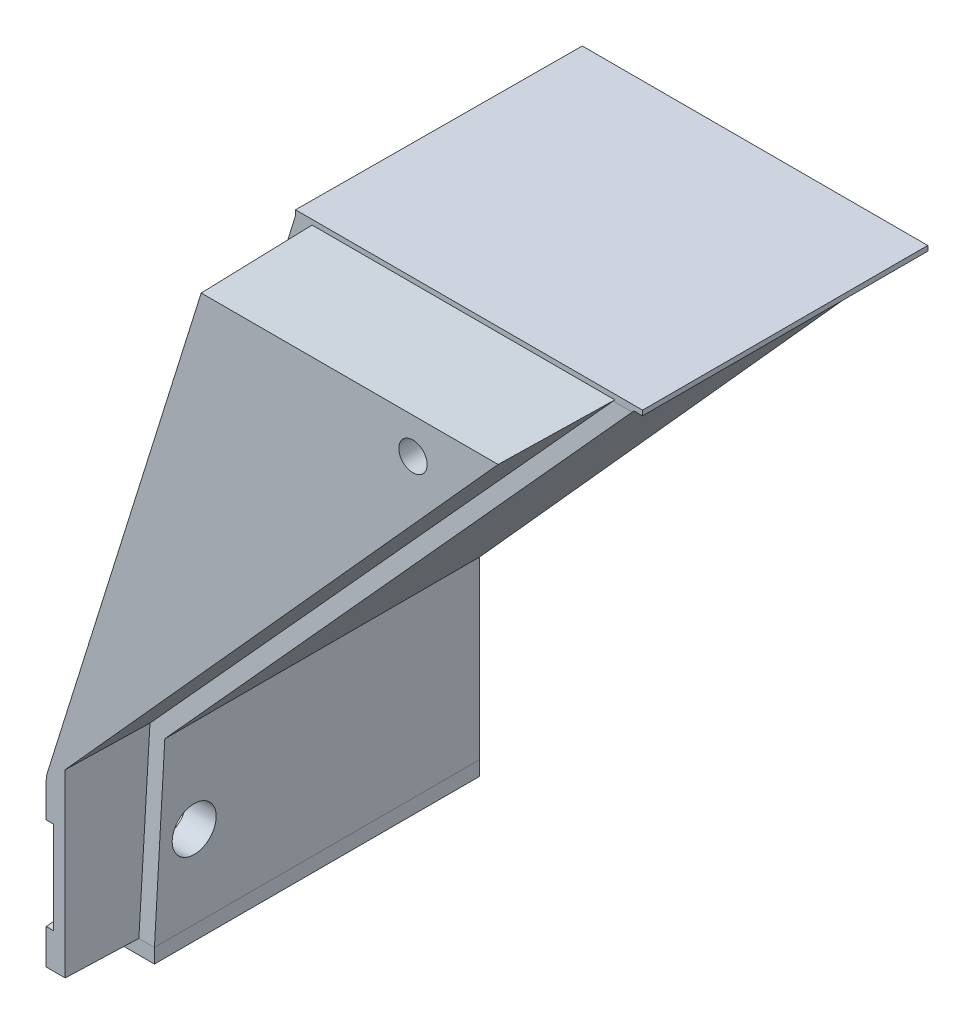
ISO-10303-21;
HEADER;
FILE_DESCRIPTION(('STEP AP214'),'2;1');
FILE_NAME('part.step','',(''),(''),'','','');
FILE_SCHEMA(('AUTOMOTIVE_DESIGN { 1 0 10303 214 1 1 1 1 }'));
ENDSEC;
DATA;
#1=APPLICATION_CONTEXT('core data for automotive mechanical design processes');
#2=APPLICATION_PROTOCOL_DEFINITION('international standard','automotive_design',2000,#1);
#3=PRODUCT_CONTEXT('',#1,'mechanical');
#4=PRODUCT('Part','Part','',(#3));
#5=PRODUCT_RELATED_PRODUCT_CATEGORY('part','',(#4));
#6=PRODUCT_DEFINITION_FORMATION('','',#4);
#7=PRODUCT_DEFINITION_CONTEXT('part definition',#1,'design');
#8=PRODUCT_DEFINITION('design','',#6,#7);
#9=PRODUCT_DEFINITION_SHAPE('','',#8);
#10=(LENGTH_UNIT() NAMED_UNIT(*) SI_UNIT(.MILLI.,.METRE.));
#11=(NAMED_UNIT(*) PLANE_ANGLE_UNIT() SI_UNIT($,.RADIAN.));
#12=(NAMED_UNIT(*) SI_UNIT($,.STERADIAN.) SOLID_ANGLE_UNIT());
#13=UNCERTAINTY_MEASURE_WITH_UNIT(LENGTH_MEASURE(1.E-05),#10,'distance_accuracy_value','');
#14=(GEOMETRIC_REPRESENTATION_CONTEXT(3) GLOBAL_UNCERTAINTY_ASSIGNED_CONTEXT((#13)) GLOBAL_UNIT_ASSIGNED_CONTEXT((#10,
#11,#12)) REPRESENTATION_CONTEXT('',''));
#15=CARTESIAN_POINT('',(0.,0.,0.));
#16=DIRECTION('',(0.,0.,1.));
#17=DIRECTION('',(1.,0.,0.));
#18=AXIS2_PLACEMENT_3D('',#15,#16,#17);
#19=CARTESIAN_POINT('',(23.3376,-29.937,-15.819588));
#20=DIRECTION('',(0.954354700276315,-0.298165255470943,-0.0174524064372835));
#21=DIRECTION('',(0.29821067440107,0.954500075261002,0.));
#22=AXIS2_PLACEMENT_3D('',#19,#20,#21);
#23=PLANE('',#22);
#24=DIRECTION('',(0.00872245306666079,-0.0305845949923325,0.999494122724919));
#25=VECTOR('',#24,1.);
#26=CARTESIAN_POINT('',(23.3362440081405,-29.9420527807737,-15.8074139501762));
#27=LINE('',#26,#25);
#28=CARTESIAN_POINT('',(23.4741932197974,-30.4257608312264,0.));
#29=VERTEX_POINT('',#28);
#30=CARTESIAN_POINT('',(23.3361377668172,-29.9416802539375,-15.819588));
#31=VERTEX_POINT('',#30);
#32=EDGE_CURVE('E378',#29,#31,#27,.F.);
#33=ORIENTED_EDGE('',*,*,#32,.F.);
#34=DIRECTION('',(0.29821067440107,0.954500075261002,0.));
#35=VECTOR('',#34,1.);
#36=CARTESIAN_POINT('',(23.6011679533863,-30.0193454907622,0.));
#37=LINE('',#36,#35);
#38=CARTESIAN_POINT('',(45.1692948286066,39.015,0.));
#39=VERTEX_POINT('',#38);
#40=EDGE_CURVE('E136',#29,#39,#37,.T.);
#41=ORIENTED_EDGE('',*,*,#40,.T.);
#42=DIRECTION('',(0.0128307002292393,-0.0174509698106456,0.999765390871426));
#43=VECTOR('',#42,1.);
#44=CARTESIAN_POINT('',(45.1467460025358,39.0456685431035,-1.75699965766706));
#45=LINE('',#44,#43);
#46=CARTESIAN_POINT('',(44.9662708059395,39.2911319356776,-15.819588));
#47=VERTEX_POINT('',#46);
#48=EDGE_CURVE('E133',#47,#39,#45,.T.);
#49=ORIENTED_EDGE('',*,*,#48,.F.);
#50=DIRECTION('',(-0.29821067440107,-0.954500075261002,0.));
#51=VECTOR('',#50,1.);
#52=CARTESIAN_POINT('',(23.3376,-29.937,-15.819588));
#53=LINE('',#52,#51);
#54=EDGE_CURVE('E140',#47,#31,#53,.T.);
#55=ORIENTED_EDGE('',*,*,#54,.T.);
#56=EDGE_LOOP('',(#33,#41,#49,#55));
#57=FACE_BOUND('',#56,.T.);
#58=ADVANCED_FACE('F36',(#57),#23,.F.);
#59=CARTESIAN_POINT('',(23.3376,-54.315,0.));
#60=DIRECTION('',(0.999961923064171,0.,-0.00872653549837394));
#61=DIRECTION('',(-0.00872653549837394,0.,-0.999961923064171));
#62=AXIS2_PLACEMENT_3D('',#59,#60,#61);
#63=PLANE('',#62);
#64=DIRECTION('',(0.00872245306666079,-0.0305845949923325,0.999494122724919));
#65=VECTOR('',#64,1.);
#66=CARTESIAN_POINT('',(23.3374777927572,-31.3206291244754,-0.0140035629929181));
#67=LINE('',#66,#65);
#68=CARTESIAN_POINT('',(23.1995445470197,-30.8369770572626,-15.819588));
#69=VERTEX_POINT('',#68);
#70=CARTESIAN_POINT('',(23.3376,-31.3210576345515,0.));
#71=VERTEX_POINT('',#70);
#72=EDGE_CURVE('E363',#69,#71,#67,.T.);
#73=ORIENTED_EDGE('',*,*,#72,.F.);
#74=DIRECTION('',(0.,1.,0.));
#75=VECTOR('',#74,1.);
#76=CARTESIAN_POINT('',(23.1995445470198,39.015,-15.819588));
#77=LINE('',#76,#75);
#78=CARTESIAN_POINT('',(23.1995445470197,-29.937,-15.819588));
#79=VERTEX_POINT('',#78);
#80=EDGE_CURVE('E633',#69,#79,#77,.T.);
#81=ORIENTED_EDGE('',*,*,#80,.T.);
#82=DIRECTION('',(0.00872653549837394,0.,0.999961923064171));
#83=VECTOR('',#82,1.);
#84=CARTESIAN_POINT('',(23.3376,-29.937,0.));
#85=LINE('',#84,#83);
#86=CARTESIAN_POINT('',(23.1907268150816,-29.937,-16.83));
#87=VERTEX_POINT('',#86);
#88=EDGE_CURVE('E670',#87,#79,#85,.T.);
#89=ORIENTED_EDGE('',*,*,#88,.F.);
#90=CARTESIAN_POINT('',(23.1907268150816,-36.057,-16.83));
#91=DIRECTION('',(0.999961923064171,0.,-0.00872653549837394));
#92=DIRECTION('',(0.00872653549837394,0.,0.999961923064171));
#93=AXIS2_PLACEMENT_3D('',#90,#91,#92);
#94=ELLIPSE('',#93,6.12023303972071,6.12);
#95=CARTESIAN_POINT('',(23.1373183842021,-36.057,-22.95));
#96=VERTEX_POINT('',#95);
#97=EDGE_CURVE('E667',#96,#87,#94,.T.);
#98=ORIENTED_EDGE('',*,*,#97,.F.);
#99=DIRECTION('',(0.,1.,0.));
#100=VECTOR('',#99,1.);
#101=CARTESIAN_POINT('',(23.1373183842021,-54.315,-22.95));
#102=LINE('',#101,#100);
#103=CARTESIAN_POINT('',(23.1373183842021,-44.115,-22.95));
#104=VERTEX_POINT('',#103);
#105=EDGE_CURVE('E658',#104,#96,#102,.T.);
#106=ORIENTED_EDGE('',*,*,#105,.F.);
#107=CARTESIAN_POINT('',(23.2263324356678,-44.115,-12.75));
#108=DIRECTION('',(0.999961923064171,0.,-0.00872653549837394));
#109=DIRECTION('',(-0.00872653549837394,0.,-0.999961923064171));
#110=AXIS2_PLACEMENT_3D('',#107,#108,#109);
#111=ELLIPSE('',#110,10.2003883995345,10.2);
#112=CARTESIAN_POINT('',(23.2263324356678,-54.315,-12.75));
#113=VERTEX_POINT('',#112);
#114=EDGE_CURVE('E657',#113,#104,#111,.T.);
#115=ORIENTED_EDGE('',*,*,#114,.F.);
#116=DIRECTION('',(0.00872653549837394,0.,0.999961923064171));
#117=VECTOR('',#116,1.);
#118=CARTESIAN_POINT('',(23.1371161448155,-54.315,-22.9731743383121));
#119=LINE('',#118,#117);
#120=CARTESIAN_POINT('',(23.2485859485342,-54.315,-10.1999999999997));
#121=VERTEX_POINT('',#120);
#122=EDGE_CURVE('E635',#113,#121,#119,.T.);
#123=ORIENTED_EDGE('',*,*,#122,.T.);
#124=DIRECTION('',(-0.0087252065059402,-0.0174517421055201,-0.999809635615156));
#125=VECTOR('',#124,1.);
#126=CARTESIAN_POINT('',(23.2472004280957,-54.3177712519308,-10.3587649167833));
#127=LINE('',#126,#125);
#128=CARTESIAN_POINT('',(23.3376,-54.1369583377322,0.));
#129=VERTEX_POINT('',#128);
#130=EDGE_CURVE('E402',#121,#129,#127,.F.);
#131=ORIENTED_EDGE('',*,*,#130,.T.);
#132=DIRECTION('',(0.,1.,0.));
#133=VECTOR('',#132,1.);
#134=CARTESIAN_POINT('',(23.3376,-54.315,0.));
#135=LINE('',#134,#133);
#136=CARTESIAN_POINT('',(23.3376,-49.189676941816,0.));
#137=VERTEX_POINT('',#136);
#138=EDGE_CURVE('E643',#129,#137,#135,.T.);
#139=ORIENTED_EDGE('',*,*,#138,.T.);
#140=DIRECTION('',(0.00869333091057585,-0.0871524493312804,0.996157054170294));
#141=VECTOR('',#140,1.);
#142=CARTESIAN_POINT('',(23.1958369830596,-47.7684732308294,-16.244432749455));
#143=LINE('',#142,#141);
#144=CARTESIAN_POINT('',(23.1957491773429,-47.7675929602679,-16.254494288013));
#145=VERTEX_POINT('',#144);
#146=EDGE_CURVE('E653',#145,#137,#143,.T.);
#147=ORIENTED_EDGE('',*,*,#146,.F.);
#148=CARTESIAN_POINT('',(23.1996282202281,-42.687,-15.81));
#149=DIRECTION('',(0.999961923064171,0.,-0.00872653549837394));
#150=DIRECTION('',(-0.00872653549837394,0.,-0.999961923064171));
#151=AXIS2_PLACEMENT_3D('',#148,#149,#150);
#152=ELLIPSE('',#151,5.10019419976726,5.1);
#153=CARTESIAN_POINT('',(23.1957491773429,-37.6064070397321,-16.254494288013));
#154=VERTEX_POINT('',#153);
#155=EDGE_CURVE('E706',#154,#145,#152,.F.);
#156=ORIENTED_EDGE('',*,*,#155,.F.);
#157=DIRECTION('',(-0.00869333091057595,-0.0871524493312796,-0.996157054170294));
#158=VECTOR('',#157,1.);
#159=CARTESIAN_POINT('',(23.3376770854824,-36.1835502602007,0.00883312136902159));
#160=LINE('',#159,#158);
#161=CARTESIAN_POINT('',(23.3376,-36.1843230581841,0.));
#162=VERTEX_POINT('',#161);
#163=EDGE_CURVE('E684',#162,#154,#160,.T.);
#164=ORIENTED_EDGE('',*,*,#163,.F.);
#165=DIRECTION('',(0.,1.,0.));
#166=VECTOR('',#165,1.);
#167=CARTESIAN_POINT('',(23.3376,-54.315,0.));
#168=LINE('',#167,#166);
#169=EDGE_CURVE('E141',#162,#71,#168,.T.);
#170=ORIENTED_EDGE('',*,*,#169,.T.);
#171=EDGE_LOOP('',(#73,#81,#89,#98,#106,#115,#123,#131,#139,#147,#156,#164,#170));
#172=FACE_BOUND('',#171,.T.);
#173=ADVANCED_FACE('F280',(#172),#63,.F.);
#174=CARTESIAN_POINT('',(-65.6145427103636,39.9924836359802,-56.));
#175=DIRECTION('',(0.,-1.,0.));
#176=DIRECTION('',(1.,0.,0.));
#177=AXIS2_PLACEMENT_3D('',#174,#175,#176);
#178=PLANE('',#177);
#179=DIRECTION('',(0.00540005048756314,0.,-0.999985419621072));
#180=VECTOR('',#179,1.);
#181=CARTESIAN_POINT('',(42.5494306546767,39.9924836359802,0.894367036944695));
#182=LINE('',#181,#180);
#183=CARTESIAN_POINT('',(42.8566734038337,39.9924871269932,-56.));
#184=VERTEX_POINT('',#183);
#185=CARTESIAN_POINT('',(42.6396881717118,39.9924836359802,-15.819588));
#186=VERTEX_POINT('',#185);
#187=EDGE_CURVE('E564',#184,#186,#182,.F.);
#188=ORIENTED_EDGE('',*,*,#187,.T.);
#189=DIRECTION('',(-1.,0.,0.));
#190=VECTOR('',#189,1.);
#191=CARTESIAN_POINT('',(-65.6145427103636,39.9924836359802,-15.819588));
#192=LINE('',#191,#190);
#193=CARTESIAN_POINT('',(91.5238680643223,39.9924836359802,-15.819588));
#194=VERTEX_POINT('',#193);
#195=EDGE_CURVE('E559',#186,#194,#192,.F.);
#196=ORIENTED_EDGE('',*,*,#195,.T.);
#197=DIRECTION('',(0.,0.,1.));
#198=VECTOR('',#197,1.);
#199=CARTESIAN_POINT('',(91.5238680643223,39.9924836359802,-61.9364789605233));
#200=LINE('',#199,#198);
#201=CARTESIAN_POINT('',(91.5238680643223,39.9924836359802,-56.));
#202=VERTEX_POINT('',#201);
#203=EDGE_CURVE('E557',#194,#202,#200,.F.);
#204=ORIENTED_EDGE('',*,*,#203,.T.);
#205=DIRECTION('',(-1.,0.,0.));
#206=VECTOR('',#205,1.);
#207=CARTESIAN_POINT('',(-91.8,39.9924836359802,-56.));
#208=LINE('',#207,#206);
#209=EDGE_CURVE('E172',#202,#184,#208,.T.);
#210=ORIENTED_EDGE('',*,*,#209,.T.);
#211=EDGE_LOOP('',(#188,#196,#204,#210));
#212=FACE_BOUND('',#211,.T.);
#213=ADVANCED_FACE('F563',(#212),#178,.F.);
#214=CARTESIAN_POINT('',(42.5502491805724,48.6764766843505,0.894371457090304));
#215=DIRECTION('',(0.99998541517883,-9.42582314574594E-05,0.00540005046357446));
#216=DIRECTION('',(0.00540005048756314,0.,-0.999985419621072));
#217=AXIS2_PLACEMENT_3D('',#214,#215,#216);
#218=PLANE('',#217);
#219=DIRECTION('',(-9.42596057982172E-05,-0.999999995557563,0.));
#220=VECTOR('',#219,1.);
#221=CARTESIAN_POINT('',(42.640506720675,48.6764681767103,-15.819588));
#222=LINE('',#221,#220);
#223=CARTESIAN_POINT('',(42.6396220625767,39.2911319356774,-15.819588));
#224=VERTEX_POINT('',#223);
#225=EDGE_CURVE('E390',#186,#224,#222,.T.);
#226=ORIENTED_EDGE('',*,*,#225,.F.);
#227=ORIENTED_EDGE('',*,*,#187,.F.);
#228=DIRECTION('',(-0.00540087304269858,-0.0174521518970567,0.99983311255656));
#229=VECTOR('',#228,1.);
#230=CARTESIAN_POINT('',(42.5502491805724,39.0023361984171,0.72550870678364));
#231=LINE('',#230,#229);
#232=EDGE_CURVE('E187',#184,#224,#231,.T.);
#233=ORIENTED_EDGE('',*,*,#232,.T.);
#234=EDGE_LOOP('',(#226,#227,#233));
#235=FACE_BOUND('',#234,.T.);
#236=ADVANCED_FACE('F252',(#235),#218,.F.);
#237=CARTESIAN_POINT('',(20.4816,-44.115,-12.75));
#238=DIRECTION('',(-1.,0.,0.));
#239=DIRECTION('',(0.,0.,1.));
#240=AXIS2_PLACEMENT_3D('',#237,#238,#239);
#241=CYLINDRICAL_SURFACE('',#240,10.2);
#242=CARTESIAN_POINT('',(20.9703045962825,-44.115,-12.75));
#243=DIRECTION('',(1.,0.,0.));
#244=DIRECTION('',(0.,0.,-1.));
#245=AXIS2_PLACEMENT_3D('',#242,#243,#244);
#246=CIRCLE('',#245,10.2);
#247=CARTESIAN_POINT('',(20.9703045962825,-54.314999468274,-12.7499999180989));
#248=VERTEX_POINT('',#247);
#249=CARTESIAN_POINT('',(20.9703045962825,-44.115,-22.95));
#250=VERTEX_POINT('',#249);
#251=EDGE_CURVE('E236',#248,#250,#246,.T.);
#252=ORIENTED_EDGE('',*,*,#251,.F.);
#253=DIRECTION('',(1.,0.,0.));
#254=VECTOR('',#253,1.);
#255=CARTESIAN_POINT('',(23.3376,-54.315,-12.75));
#256=LINE('',#255,#254);
#257=EDGE_CURVE('E655',#248,#113,#256,.T.);
#258=ORIENTED_EDGE('',*,*,#257,.T.);
#259=ORIENTED_EDGE('',*,*,#114,.T.);
#260=DIRECTION('',(1.,0.,0.));
#261=VECTOR('',#260,1.);
#262=CARTESIAN_POINT('',(20.4816,-44.115,-22.95));
#263=LINE('',#262,#261);
#264=EDGE_CURVE('E659',#104,#250,#263,.F.);
#265=ORIENTED_EDGE('',*,*,#264,.T.);
#266=EDGE_LOOP('',(#252,#258,#259,#265));
#267=FACE_BOUND('',#266,.T.);
#268=ADVANCED_FACE('F248',(#267),#241,.F.);
#269=CARTESIAN_POINT('',(5.049,41.565,-10.2));
#270=DIRECTION('',(0.,0.,-1.));
#271=DIRECTION('',(-1.,0.,0.));
#272=AXIS2_PLACEMENT_3D('',#269,#270,#271);
#273=PLANE('',#272);
#274=DIRECTION('',(0.,-1.,0.));
#275=VECTOR('',#274,1.);
#276=CARTESIAN_POINT('',(20.9703045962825,41.565,-10.2));
#277=LINE('',#276,#275);
#278=CARTESIAN_POINT('',(20.9703045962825,-56.355,-10.2));
#279=VERTEX_POINT('',#278);
#280=CARTESIAN_POINT('',(20.9703045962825,-54.315,-10.2));
#281=VERTEX_POINT('',#280);
#282=EDGE_CURVE('E192',#279,#281,#277,.F.);
#283=ORIENTED_EDGE('',*,*,#282,.F.);
#284=DIRECTION('',(1.,0.,0.));
#285=VECTOR('',#284,1.);
#286=CARTESIAN_POINT('',(5.049,-56.355,-10.2));
#287=LINE('',#286,#285);
#288=CARTESIAN_POINT('',(28.3813369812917,-56.355,-10.2));
#289=VERTEX_POINT('',#288);
#290=EDGE_CURVE('E144',#279,#289,#287,.T.);
#291=ORIENTED_EDGE('',*,*,#290,.T.);
#292=DIRECTION('',(-0.000304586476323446,-0.999999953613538,0.));
#293=VECTOR('',#292,1.);
#294=CARTESIAN_POINT('',(28.4111599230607,41.5578842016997,-10.2));
#295=LINE('',#294,#293);
#296=CARTESIAN_POINT('',(28.3819583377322,-54.315,-10.2000000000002));
#297=VERTEX_POINT('',#296);
#298=EDGE_CURVE('E163',#297,#289,#295,.T.);
#299=ORIENTED_EDGE('',*,*,#298,.F.);
#300=DIRECTION('',(-1.,0.,0.));
#301=VECTOR('',#300,1.);
#302=CARTESIAN_POINT('',(538.56,-54.315,-10.2000000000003));
#303=LINE('',#302,#301);
#304=CARTESIAN_POINT('',(26.1880416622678,-54.315,-10.2));
#305=VERTEX_POINT('',#304);
#306=EDGE_CURVE('E149',#297,#305,#303,.T.);
#307=ORIENTED_EDGE('',*,*,#306,.T.);
#308=DIRECTION('',(1.,0.,0.));
#309=VECTOR('',#308,1.);
#310=CARTESIAN_POINT('',(5.049,-54.315,-10.2));
#311=LINE('',#310,#309);
#312=EDGE_CURVE('E156',#121,#305,#311,.T.);
#313=ORIENTED_EDGE('',*,*,#312,.F.);
#314=EDGE_CURVE('E160',#281,#121,#311,.T.);
#315=ORIENTED_EDGE('',*,*,#314,.F.);
#316=EDGE_LOOP('',(#283,#291,#299,#307,#313,#315));
#317=FACE_BOUND('',#316,.T.);
#318=ADVANCED_FACE('F251',(#317),#273,.F.);
#319=CARTESIAN_POINT('',(20.4816,-54.315,-22.95));
#320=DIRECTION('',(0.,-1.,0.));
#321=DIRECTION('',(0.,0.,-1.));
#322=AXIS2_PLACEMENT_3D('',#319,#320,#321);
#323=PLANE('',#322);
#324=DIRECTION('',(0.,0.,1.));
#325=VECTOR('',#324,1.);
#326=CARTESIAN_POINT('',(20.9703045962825,-54.315,0.0302923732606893));
#327=LINE('',#326,#325);
#328=CARTESIAN_POINT('',(20.9703045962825,-54.315,-12.7467061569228));
#329=VERTEX_POINT('',#328);
#330=EDGE_CURVE('E53',#281,#329,#327,.F.);
#331=ORIENTED_EDGE('',*,*,#330,.F.);
#332=ORIENTED_EDGE('',*,*,#314,.T.);
#333=ORIENTED_EDGE('',*,*,#122,.F.);
#334=ORIENTED_EDGE('',*,*,#257,.F.);
#335=CARTESIAN_POINT('',(20.9703045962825,-54.315,-12.7467061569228));
#336=CARTESIAN_POINT('',(20.9703045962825,-54.315000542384,-12.8512262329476));
#337=CARTESIAN_POINT('',(20.9703045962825,-54.3133937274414,-12.9557462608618));
#338=CARTESIAN_POINT('',(20.9703045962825,-54.306981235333,-13.1642990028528));
#339=CARTESIAN_POINT('',(20.9703045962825,-54.3021874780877,-13.2683320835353));
#340=CARTESIAN_POINT('',(20.9703045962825,-54.2894346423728,-13.4759131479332));
#341=CARTESIAN_POINT('',(20.9703045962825,-54.2814844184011,-13.5794616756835));
#342=CARTESIAN_POINT('',(20.9703045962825,-54.2624438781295,-13.7860753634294));
#343=CARTESIAN_POINT('',(20.9703045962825,-54.2513594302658,-13.8891410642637));
#344=CARTESIAN_POINT('',(20.9703045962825,-54.2260665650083,-14.0947903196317));
#345=CARTESIAN_POINT('',(20.9703045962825,-54.2118610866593,-14.1973742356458));
#346=CARTESIAN_POINT('',(20.9703045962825,-54.1803333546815,-14.4020619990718));
#347=CARTESIAN_POINT('',(20.9703045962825,-54.1630111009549,-14.5041658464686));
#348=CARTESIAN_POINT('',(20.9703045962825,-54.1252481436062,-14.7078943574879));
#349=CARTESIAN_POINT('',(20.9703045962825,-54.1048045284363,-14.8095184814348));
#350=CARTESIAN_POINT('',(20.9703045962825,-54.0607887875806,-15.0122852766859));
#351=CARTESIAN_POINT('',(20.9703045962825,-54.0372109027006,-15.1134266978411));
#352=CARTESIAN_POINT('',(20.9703045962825,-53.9869077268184,-15.315223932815));
#353=CARTESIAN_POINT('',(20.9703045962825,-53.9601738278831,-15.415877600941));
#354=CARTESIAN_POINT('',(20.9703045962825,-53.9035316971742,-15.6166935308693));
#355=CARTESIAN_POINT('',(20.9703045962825,-53.8736119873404,-15.7168525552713));
#356=CARTESIAN_POINT('',(20.9703045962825,-53.8421593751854,-15.8165279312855));
#357=B_SPLINE_CURVE_WITH_KNOTS('',3,(#335,#336,#337,#338,#339,#340,#341,#342,#343,#344,#345,
#346,#347,#348,#349,#350,#351,#352,#353,#354,#355,#356),.UNSPECIFIED.,.F.,.F.,(4,2,2,2,2,2,2,2,
2,2,4),(0.,0.313547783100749,0.62592937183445,0.937440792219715,1.24837276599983,
1.55901318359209,1.86965361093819,2.18058558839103,2.49209700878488,2.80447859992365,
3.11802639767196),.UNSPECIFIED.);
#358=EDGE_CURVE('E571',#329,#248,#357,.T.);
#359=ORIENTED_EDGE('',*,*,#358,.F.);
#360=EDGE_LOOP('',(#331,#332,#333,#334,#359));
#361=FACE_BOUND('',#360,.T.);
#362=ADVANCED_FACE('F246',(#361),#323,.F.);
#363=CARTESIAN_POINT('',(170.,-124.,-56.));
#364=DIRECTION('',(0.,0.,1.));
#365=DIRECTION('',(1.,0.,0.));
#366=AXIS2_PLACEMENT_3D('',#363,#364,#365);
#367=PLANE('',#366);
#368=CARTESIAN_POINT('',(24.6639555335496,-43.355,-56.));
#369=DIRECTION('',(0.,0.,1.));
#370=DIRECTION('',(1.,0.,0.));
#371=AXIS2_PLACEMENT_3D('',#368,#369,#370);
#372=CIRCLE('',#371,3.);
#373=CARTESIAN_POINT('',(27.6639555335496,-43.355,-56.));
#374=VERTEX_POINT('',#373);
#375=EDGE_CURVE('E45',#374,#374,#372,.T.);
#376=ORIENTED_EDGE('',*,*,#375,.T.);
#377=EDGE_LOOP('',(#376));
#378=FACE_BOUND('',#377,.T.);
#379=CARTESIAN_POINT('',(62.0000177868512,24.1988680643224,-56.));
#380=DIRECTION('',(0.,0.,1.));
#381=DIRECTION('',(1.,0.,0.));
#382=AXIS2_PLACEMENT_3D('',#379,#380,#381);
#383=CIRCLE('',#382,4.);
#384=CARTESIAN_POINT('',(66.0000177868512,24.1988680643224,-56.));
#385=VERTEX_POINT('',#384);
#386=EDGE_CURVE('E235',#385,#385,#383,.T.);
#387=ORIENTED_EDGE('',*,*,#386,.T.);
#388=EDGE_LOOP('',(#387));
#389=FACE_BOUND('',#388,.T.);
#390=CARTESIAN_POINT('',(47.0000080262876,7.,-56.));
#391=DIRECTION('',(0.,0.,1.));
#392=DIRECTION('',(1.,0.,0.));
#393=AXIS2_PLACEMENT_3D('',#390,#391,#392);
#394=CIRCLE('',#393,4.);
#395=CARTESIAN_POINT('',(51.0000080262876,7.,-56.));
#396=VERTEX_POINT('',#395);
#397=EDGE_CURVE('E348',#396,#396,#394,.T.);
#398=ORIENTED_EDGE('',*,*,#397,.T.);
#399=EDGE_LOOP('',(#398));
#400=FACE_BOUND('',#399,.T.);
#401=CARTESIAN_POINT('',(21.1044951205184,-30.2965631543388,-56.));
#402=CARTESIAN_POINT('',(21.0820336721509,-30.3691489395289,-56.));
#403=CARTESIAN_POINT('',(21.0623486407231,-30.4425774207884,-56.));
#404=CARTESIAN_POINT('',(21.0285971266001,-30.5907141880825,-56.));
#405=CARTESIAN_POINT('',(21.0145305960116,-30.665422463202,-56.));
#406=CARTESIAN_POINT('',(20.9813947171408,-30.8872594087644,-56.));
#407=CARTESIAN_POINT('',(20.9703129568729,-31.0356183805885,-56.));
#408=CARTESIAN_POINT('',(20.9703045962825,-31.1841392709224,-56.));
#409=B_SPLINE_CURVE_WITH_KNOTS('',3,(#401,#402,#403,#404,#405,#406,#407,#408),.UNSPECIFIED.,.F.,
.F.,(4,2,2,4),(0.,0.227859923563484,0.455717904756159,0.900514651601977),.UNSPECIFIED.);
#410=CARTESIAN_POINT('',(21.1044951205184,-30.2965631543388,-56.));
#411=VERTEX_POINT('',#410);
#412=CARTESIAN_POINT('',(20.9703045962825,-31.1841392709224,-56.));
#413=VERTEX_POINT('',#412);
#414=EDGE_CURVE('E184',#411,#413,#409,.T.);
#415=ORIENTED_EDGE('',*,*,#414,.F.);
#416=DIRECTION('',(-0.295634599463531,-0.955301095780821,0.));
#417=VECTOR('',#416,1.);
#418=CARTESIAN_POINT('',(31.9265236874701,4.67328058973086,-56.));
#419=LINE('',#418,#417);
#420=EDGE_CURVE('E169',#184,#411,#419,.T.);
#421=ORIENTED_EDGE('',*,*,#420,.F.);
#422=ORIENTED_EDGE('',*,*,#209,.F.);
#423=DIRECTION('',(0.,1.,0.));
#424=VECTOR('',#423,1.);
#425=CARTESIAN_POINT('',(91.5238680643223,62.1988680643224,-56.));
#426=LINE('',#425,#424);
#427=CARTESIAN_POINT('',(91.5238680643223,39.2911319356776,-56.));
#428=VERTEX_POINT('',#427);
#429=EDGE_CURVE('E549',#428,#202,#426,.T.);
#430=ORIENTED_EDGE('',*,*,#429,.F.);
#431=DIRECTION('',(1.,0.,0.));
#432=VECTOR('',#431,1.);
#433=CARTESIAN_POINT('',(91.5238680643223,39.2911319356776,-56.));
#434=LINE('',#433,#432);
#435=CARTESIAN_POINT('',(90.3091950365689,39.2911319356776,-56.));
#436=VERTEX_POINT('',#435);
#437=EDGE_CURVE('E552',#436,#428,#434,.T.);
#438=ORIENTED_EDGE('',*,*,#437,.F.);
#439=DIRECTION('',(0.668549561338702,0.743667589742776,0.));
#440=VECTOR('',#439,1.);
#441=CARTESIAN_POINT('',(90.3091950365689,39.2911319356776,-56.));
#442=LINE('',#441,#440);
#443=CARTESIAN_POINT('',(28.3560070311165,-29.6230977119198,-56.));
#444=VERTEX_POINT('',#443);
#445=EDGE_CURVE('E78',#444,#436,#442,.T.);
#446=ORIENTED_EDGE('',*,*,#445,.F.);
#447=DIRECTION('',(-0.00105100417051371,0.999999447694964,0.));
#448=VECTOR('',#447,1.);
#449=CARTESIAN_POINT('',(28.3560070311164,-29.6230977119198,-56.));
#450=LINE('',#449,#448);
#451=CARTESIAN_POINT('',(28.3819583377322,-54.315,-56.));
#452=VERTEX_POINT('',#451);
#453=EDGE_CURVE('E748',#452,#444,#450,.T.);
#454=ORIENTED_EDGE('',*,*,#453,.F.);
#455=DIRECTION('',(-0.000304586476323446,-0.999999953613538,0.));
#456=VECTOR('',#455,1.);
#457=CARTESIAN_POINT('',(28.3607463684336,-123.956858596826,-56.));
#458=LINE('',#457,#456);
#459=CARTESIAN_POINT('',(28.3813369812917,-56.355,-56.));
#460=VERTEX_POINT('',#459);
#461=EDGE_CURVE('E165',#452,#460,#458,.T.);
#462=ORIENTED_EDGE('',*,*,#461,.T.);
#463=DIRECTION('',(-1.,0.,0.));
#464=VECTOR('',#463,1.);
#465=CARTESIAN_POINT('',(5.049,-56.355,-56.));
#466=LINE('',#465,#464);
#467=CARTESIAN_POINT('',(20.9703045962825,-56.355,-56.));
#468=VERTEX_POINT('',#467);
#469=EDGE_CURVE('E166',#468,#460,#466,.F.);
#470=ORIENTED_EDGE('',*,*,#469,.F.);
#471=DIRECTION('',(0.,-1.,0.));
#472=VECTOR('',#471,1.);
#473=CARTESIAN_POINT('',(20.9703045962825,-41.6589844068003,-56.));
#474=LINE('',#473,#472);
#475=EDGE_CURVE('E178',#413,#468,#474,.T.);
#476=ORIENTED_EDGE('',*,*,#475,.F.);
#477=EDGE_LOOP('',(#415,#421,#422,#430,#438,#446,#454,#462,#470,#476));
#478=FACE_BOUND('',#477,.T.);
#479=CARTESIAN_POINT('',(75.0000080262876,33.9924836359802,-56.));
#480=DIRECTION('',(0.,0.,1.));
#481=DIRECTION('',(1.,0.,0.));
#482=AXIS2_PLACEMENT_3D('',#479,#480,#481);
#483=CIRCLE('',#482,2.);
#484=CARTESIAN_POINT('',(77.0000080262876,33.9924836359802,-56.));
#485=VERTEX_POINT('',#484);
#486=EDGE_CURVE('E345',#485,#485,#483,.F.);
#487=ORIENTED_EDGE('',*,*,#486,.F.);
#488=EDGE_LOOP('',(#487));
#489=FACE_BOUND('',#488,.T.);
#490=ADVANCED_FACE('F244',(#378,#389,#400,#478,#489),#367,.F.);
#491=CARTESIAN_POINT('',(23.3376,-36.057,-16.83));
#492=DIRECTION('',(1.,0.,0.));
#493=DIRECTION('',(0.,0.,-1.));
#494=AXIS2_PLACEMENT_3D('',#491,#492,#493);
#495=CYLINDRICAL_SURFACE('',#494,6.12);
#496=CARTESIAN_POINT('',(20.9703045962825,-36.057,-16.83));
#497=DIRECTION('',(1.,0.,0.));
#498=DIRECTION('',(0.,0.,-1.));
#499=AXIS2_PLACEMENT_3D('',#496,#497,#498);
#500=CIRCLE('',#499,6.12);
#501=CARTESIAN_POINT('',(20.9703045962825,-36.057,-22.95));
#502=VERTEX_POINT('',#501);
#503=CARTESIAN_POINT('',(20.9703045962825,-31.1841392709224,-20.5326515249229));
#504=VERTEX_POINT('',#503);
#505=EDGE_CURVE('E676',#502,#504,#500,.T.);
#506=ORIENTED_EDGE('',*,*,#505,.F.);
#507=DIRECTION('',(-1.,0.,0.));
#508=VECTOR('',#507,1.);
#509=CARTESIAN_POINT('',(23.3376,-36.057,-22.95));
#510=LINE('',#509,#508);
#511=EDGE_CURVE('E662',#502,#96,#510,.F.);
#512=ORIENTED_EDGE('',*,*,#511,.T.);
#513=ORIENTED_EDGE('',*,*,#97,.T.);
#514=DIRECTION('',(-1.,0.,0.));
#515=VECTOR('',#514,1.);
#516=CARTESIAN_POINT('',(20.4816,-29.937,-16.83));
#517=LINE('',#516,#515);
#518=CARTESIAN_POINT('',(21.2157682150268,-29.937,-16.83));
#519=VERTEX_POINT('',#518);
#520=EDGE_CURVE('E664',#87,#519,#517,.T.);
#521=ORIENTED_EDGE('',*,*,#520,.T.);
#522=CARTESIAN_POINT('',(19.3218273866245,-36.057,-16.83));
#523=DIRECTION('',(0.955301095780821,-0.295634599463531,0.));
#524=DIRECTION('',(0.295634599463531,0.955301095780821,0.));
#525=AXIS2_PLACEMENT_3D('',#522,#523,#524);
#526=ELLIPSE('',#525,6.40635714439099,6.12);
#527=CARTESIAN_POINT('',(21.1044951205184,-30.2965631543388,-18.8968254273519));
#528=VERTEX_POINT('',#527);
#529=EDGE_CURVE('E183',#519,#528,#526,.F.);
#530=ORIENTED_EDGE('',*,*,#529,.T.);
#531=CARTESIAN_POINT('',(20.9703045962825,-31.1841392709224,-20.5326515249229));
#532=CARTESIAN_POINT('',(20.9703075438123,-31.1381480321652,-20.4721267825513));
#533=CARTESIAN_POINT('',(20.9713679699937,-31.0932939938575,-20.4107539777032));
#534=CARTESIAN_POINT('',(20.9752998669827,-31.0059371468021,-20.2864332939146));
#535=CARTESIAN_POINT('',(20.9781709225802,-30.9634338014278,-20.2234857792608));
#536=CARTESIAN_POINT('',(20.9873905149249,-30.8583873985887,-20.0614940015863));
#537=CARTESIAN_POINT('',(20.9947809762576,-30.7975080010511,-19.9614254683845));
#538=CARTESIAN_POINT('',(21.0121261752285,-30.6816554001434,-19.7581001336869));
#539=CARTESIAN_POINT('',(21.0220820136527,-30.6266847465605,-19.6548419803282));
#540=CARTESIAN_POINT('',(21.043752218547,-30.5220517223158,-19.4439629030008));
#541=CARTESIAN_POINT('',(21.0554900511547,-30.4724781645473,-19.3363003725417));
#542=CARTESIAN_POINT('',(21.0796834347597,-30.379716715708,-19.1184202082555));
#543=CARTESIAN_POINT('',(21.0921385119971,-30.3365246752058,-19.0082042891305));
#544=CARTESIAN_POINT('',(21.1044951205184,-30.2965631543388,-18.896825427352));
#545=B_SPLINE_CURVE_WITH_KNOTS('',3,(#531,#532,#533,#534,#535,#536,#537,#538,#539,#540,#541,
#542,#543,#544),.UNSPECIFIED.,.F.,.F.,(4,2,2,2,2,2,4),(0.,0.228006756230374,0.455961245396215,
0.807809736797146,1.15980945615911,1.51692771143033,1.87381272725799),.UNSPECIFIED.);
#546=EDGE_CURVE('E228',#504,#528,#545,.T.);
#547=ORIENTED_EDGE('',*,*,#546,.F.);
#548=EDGE_LOOP('',(#506,#512,#513,#521,#530,#547));
#549=FACE_BOUND('',#548,.T.);
#550=ADVANCED_FACE('F238',(#549),#495,.F.);
#551=CARTESIAN_POINT('',(20.4816,-54.315,-22.95));
#552=DIRECTION('',(0.,0.,1.));
#553=DIRECTION('',(1.,0.,0.));
#554=AXIS2_PLACEMENT_3D('',#551,#552,#553);
#555=PLANE('',#554);
#556=ORIENTED_EDGE('',*,*,#511,.F.);
#557=DIRECTION('',(0.,1.,0.));
#558=VECTOR('',#557,1.);
#559=CARTESIAN_POINT('',(20.9703045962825,-54.315,-22.95));
#560=LINE('',#559,#558);
#561=EDGE_CURVE('E727',#502,#250,#560,.F.);
#562=ORIENTED_EDGE('',*,*,#561,.T.);
#563=ORIENTED_EDGE('',*,*,#264,.F.);
#564=ORIENTED_EDGE('',*,*,#105,.T.);
#565=EDGE_LOOP('',(#556,#562,#563,#564));
#566=FACE_BOUND('',#565,.T.);
#567=ADVANCED_FACE('F243',(#566),#555,.T.);
#568=CARTESIAN_POINT('',(91.5238680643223,62.1988680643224,-61.719588));
#569=DIRECTION('',(-1.,0.,0.));
#570=DIRECTION('',(0.,0.,1.));
#571=AXIS2_PLACEMENT_3D('',#568,#569,#570);
#572=PLANE('',#571);
#573=ORIENTED_EDGE('',*,*,#203,.F.);
#574=DIRECTION('',(0.,1.,0.));
#575=VECTOR('',#574,1.);
#576=CARTESIAN_POINT('',(91.5238680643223,39.015,-15.819588));
#577=LINE('',#576,#575);
#578=CARTESIAN_POINT('',(91.5238680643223,39.2911319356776,-15.819588));
#579=VERTEX_POINT('',#578);
#580=EDGE_CURVE('E361',#579,#194,#577,.T.);
#581=ORIENTED_EDGE('',*,*,#580,.F.);
#582=DIRECTION('',(0.,0.,1.));
#583=VECTOR('',#582,1.);
#584=CARTESIAN_POINT('',(91.5238680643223,39.2911319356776,-61.719588));
#585=LINE('',#584,#583);
#586=EDGE_CURVE('E112',#428,#579,#585,.T.);
#587=ORIENTED_EDGE('',*,*,#586,.F.);
#588=ORIENTED_EDGE('',*,*,#429,.T.);
#589=EDGE_LOOP('',(#573,#581,#587,#588));
#590=FACE_BOUND('',#589,.T.);
#591=ADVANCED_FACE('F282',(#590),#572,.F.);
#592=CARTESIAN_POINT('',(91.5238680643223,39.2911319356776,-61.719588));
#593=DIRECTION('',(0.,1.,0.));
#594=DIRECTION('',(0.,0.,1.));
#595=AXIS2_PLACEMENT_3D('',#592,#593,#594);
#596=PLANE('',#595);
#597=DIRECTION('',(0.,0.,1.));
#598=VECTOR('',#597,1.);
#599=CARTESIAN_POINT('',(90.3091950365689,39.2911319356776,-61.719588));
#600=LINE('',#599,#598);
#601=CARTESIAN_POINT('',(90.3091950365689,39.2911319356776,-15.819588));
#602=VERTEX_POINT('',#601);
#603=EDGE_CURVE('E94',#436,#602,#600,.T.);
#604=ORIENTED_EDGE('',*,*,#603,.F.);
#605=ORIENTED_EDGE('',*,*,#437,.T.);
#606=ORIENTED_EDGE('',*,*,#586,.T.);
#607=DIRECTION('',(-1.,0.,0.));
#608=VECTOR('',#607,1.);
#609=CARTESIAN_POINT('',(91.8,39.2911319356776,-15.819588));
#610=LINE('',#609,#608);
#611=EDGE_CURVE('E102',#579,#602,#610,.T.);
#612=ORIENTED_EDGE('',*,*,#611,.T.);
#613=EDGE_LOOP('',(#604,#605,#606,#612));
#614=FACE_BOUND('',#613,.T.);
#615=ADVANCED_FACE('F115',(#614),#596,.F.);
#616=CARTESIAN_POINT('',(91.8,39.015,-15.819588));
#617=DIRECTION('',(0.,0.,1.));
#618=DIRECTION('',(1.,0.,0.));
#619=AXIS2_PLACEMENT_3D('',#616,#617,#618);
#620=PLANE('',#619);
#621=DIRECTION('',(0.668549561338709,0.74366758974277,0.));
#622=VECTOR('',#621,1.);
#623=CARTESIAN_POINT('',(90.0609552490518,39.0150000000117,-15.819588));
#624=LINE('',#623,#622);
#625=CARTESIAN_POINT('',(90.0609552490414,39.015,-15.819588));
#626=VERTEX_POINT('',#625);
#627=EDGE_CURVE('E97',#626,#602,#624,.T.);
#628=ORIENTED_EDGE('',*,*,#627,.T.);
#629=ORIENTED_EDGE('',*,*,#611,.F.);
#630=ORIENTED_EDGE('',*,*,#580,.T.);
#631=ORIENTED_EDGE('',*,*,#195,.F.);
#632=ORIENTED_EDGE('',*,*,#225,.T.);
#633=DIRECTION('',(0.295634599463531,0.955301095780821,0.));
#634=VECTOR('',#633,1.);
#635=CARTESIAN_POINT('',(31.9265236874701,4.67328058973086,-15.819588));
#636=LINE('',#635,#634);
#637=CARTESIAN_POINT('',(21.2157682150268,-29.937,-15.819588));
#638=VERTEX_POINT('',#637);
#639=EDGE_CURVE('E180',#638,#224,#636,.T.);
#640=ORIENTED_EDGE('',*,*,#639,.F.);
#641=DIRECTION('',(-1.,0.,0.));
#642=VECTOR('',#641,1.);
#643=CARTESIAN_POINT('',(20.4816,-29.937,-15.819588));
#644=LINE('',#643,#642);
#645=EDGE_CURVE('E640',#79,#638,#644,.T.);
#646=ORIENTED_EDGE('',*,*,#645,.F.);
#647=ORIENTED_EDGE('',*,*,#80,.F.);
#648=CARTESIAN_POINT('',(26.199658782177,-30.8377781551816,-15.819588));
#649=DIRECTION('',(0.,0.,1.));
#650=DIRECTION('',(-0.274255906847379,0.961656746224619,0.));
#651=AXIS2_PLACEMENT_3D('',#648,#649,#650);
#652=ELLIPSE('',#651,3.00151839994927,3.);
#653=EDGE_CURVE('E387',#31,#69,#652,.T.);
#654=ORIENTED_EDGE('',*,*,#653,.F.);
#655=ORIENTED_EDGE('',*,*,#54,.F.);
#656=DIRECTION('',(1.,0.,0.));
#657=VECTOR('',#656,1.);
#658=CARTESIAN_POINT('',(91.8,39.2911319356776,-15.819588));
#659=LINE('',#658,#657);
#660=CARTESIAN_POINT('',(87.6213664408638,39.2911319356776,-15.819588));
#661=VERTEX_POINT('',#660);
#662=EDGE_CURVE('E364',#47,#661,#659,.T.);
#663=ORIENTED_EDGE('',*,*,#662,.T.);
#664=DIRECTION('',(0.669130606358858,0.743144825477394,0.));
#665=VECTOR('',#664,1.);
#666=CARTESIAN_POINT('',(87.2063699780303,38.830231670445,-15.819588));
#667=LINE('',#666,#665);
#668=CARTESIAN_POINT('',(87.3727361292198,39.015,-15.819588));
#669=VERTEX_POINT('',#668);
#670=EDGE_CURVE('E127',#669,#661,#667,.T.);
#671=ORIENTED_EDGE('',*,*,#670,.F.);
#672=DIRECTION('',(1.,0.,0.));
#673=VECTOR('',#672,1.);
#674=CARTESIAN_POINT('',(90.4325274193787,39.015,-15.819588));
#675=LINE('',#674,#673);
#676=EDGE_CURVE('E111',#669,#626,#675,.T.);
#677=ORIENTED_EDGE('',*,*,#676,.T.);
#678=EDGE_LOOP('',(#628,#629,#630,#631,#632,#640,#646,#647,#654,#655,#663,#671,#677));
#679=FACE_BOUND('',#678,.T.);
#680=ADVANCED_FACE('F106',(#679),#620,.T.);
#681=CARTESIAN_POINT('',(951.868,-42.687,-15.81));
#682=DIRECTION('',(-1.,0.,0.));
#683=DIRECTION('',(0.,0.,1.));
#684=AXIS2_PLACEMENT_3D('',#681,#682,#683);
#685=CYLINDRICAL_SURFACE('',#684,3.1);
#686=CARTESIAN_POINT('',(28.3697372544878,-42.687,-15.81));
#687=DIRECTION('',(-0.999999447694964,-0.00105100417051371,0.));
#688=DIRECTION('',(-0.00105100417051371,0.999999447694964,0.));
#689=AXIS2_PLACEMENT_3D('',#686,#687,#688);
#690=ELLIPSE('',#689,3.10000171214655,3.1);
#691=CARTESIAN_POINT('',(28.3664791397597,-39.587,-15.81));
#692=VERTEX_POINT('',#691);
#693=EDGE_CURVE('E162',#692,#692,#690,.F.);
#694=ORIENTED_EDGE('',*,*,#693,.T.);
#695=EDGE_LOOP('',(#694));
#696=FACE_BOUND('',#695,.T.);
#697=CARTESIAN_POINT('',(24.219628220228,-42.687,-15.81));
#698=DIRECTION('',(0.999961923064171,0.,-0.00872653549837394));
#699=DIRECTION('',(-0.00872653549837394,0.,-0.999961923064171));
#700=AXIS2_PLACEMENT_3D('',#697,#698,#699);
#701=ELLIPSE('',#700,3.10011804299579,3.1);
#702=CARTESIAN_POINT('',(24.1925749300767,-42.6870000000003,-18.91));
#703=VERTEX_POINT('',#702);
#704=EDGE_CURVE('E719',#703,#703,#701,.T.);
#705=ORIENTED_EDGE('',*,*,#704,.F.);
#706=EDGE_LOOP('',(#705));
#707=FACE_BOUND('',#706,.T.);
#708=ADVANCED_FACE('F262',(#696,#707),#685,.F.);
#709=CARTESIAN_POINT('',(87.0011639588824,39.015,0.));
#710=DIRECTION('',(-0.743031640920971,0.669028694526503,-0.0174524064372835));
#711=DIRECTION('',(-0.669130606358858,-0.743144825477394,0.));
#712=AXIS2_PLACEMENT_3D('',#709,#710,#711);
#713=PLANE('',#712);
#714=DIRECTION('',(-0.669130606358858,-0.743144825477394,0.));
#715=VECTOR('',#714,1.);
#716=CARTESIAN_POINT('',(87.0011639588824,39.015,0.));
#717=LINE('',#716,#715);
#718=CARTESIAN_POINT('',(87.0011639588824,39.015,0.));
#719=VERTEX_POINT('',#718);
#720=CARTESIAN_POINT('',(26.01,-28.722549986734,0.));
#721=VERTEX_POINT('',#720);
#722=EDGE_CURVE('E126',#719,#721,#717,.T.);
#723=ORIENTED_EDGE('',*,*,#722,.T.);
#724=DIRECTION('',(-0.01745201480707,0.00669920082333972,0.999825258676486));
#725=VECTOR('',#724,1.);
#726=CARTESIAN_POINT('',(26.0206567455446,-28.7266407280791,-0.610524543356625));
#727=LINE('',#726,#725);
#728=CARTESIAN_POINT('',(26.2148568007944,-28.8011871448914,-11.7362382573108));
#729=VERTEX_POINT('',#728);
#730=EDGE_CURVE('E358',#729,#721,#727,.T.);
#731=ORIENTED_EDGE('',*,*,#730,.F.);
#732=DIRECTION('',(0.66904191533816,0.741881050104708,-0.0446701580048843));
#733=VECTOR('',#732,1.);
#734=CARTESIAN_POINT('',(86.7336265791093,38.306310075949,-15.7769163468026));
#735=LINE('',#734,#733);
#736=EDGE_CURVE('E130',#729,#669,#735,.T.);
#737=ORIENTED_EDGE('',*,*,#736,.T.);
#738=ORIENTED_EDGE('',*,*,#670,.T.);
#739=DIRECTION('',(-0.0391686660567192,-0.0174390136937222,0.999080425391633));
#740=VECTOR('',#739,1.);
#741=CARTESIAN_POINT('',(87.0011639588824,39.015,0.));
#742=LINE('',#741,#740);
#743=EDGE_CURVE('E123',#661,#719,#742,.T.);
#744=ORIENTED_EDGE('',*,*,#743,.T.);
#745=EDGE_LOOP('',(#723,#731,#737,#738,#744));
#746=FACE_BOUND('',#745,.T.);
#747=ADVANCED_FACE('F265',(#746),#713,.F.);
#748=CARTESIAN_POINT('',(538.56,-54.315,-10.2000000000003));
#749=DIRECTION('',(0.,0.0601031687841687,0.998192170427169));
#750=DIRECTION('',(0.,-0.998192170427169,0.0601031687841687));
#751=AXIS2_PLACEMENT_3D('',#748,#749,#750);
#752=PLANE('',#751);
#753=ORIENTED_EDGE('',*,*,#736,.F.);
#754=DIRECTION('',(0.00104910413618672,0.998191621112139,-0.0601031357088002));
#755=VECTOR('',#754,1.);
#756=CARTESIAN_POINT('',(26.2141989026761,-29.4271577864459,-11.6985472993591));
#757=LINE('',#756,#755);
#758=EDGE_CURVE('E396',#305,#729,#757,.T.);
#759=ORIENTED_EDGE('',*,*,#758,.F.);
#760=ORIENTED_EDGE('',*,*,#306,.F.);
#761=DIRECTION('',(0.00104910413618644,-0.998191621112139,0.0601031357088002));
#762=VECTOR('',#761,1.);
#763=CARTESIAN_POINT('',(28.3826016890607,-54.927129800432,-10.1631424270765));
#764=LINE('',#763,#762);
#765=CARTESIAN_POINT('',(28.3560070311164,-29.6230977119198,-11.6867493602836));
#766=VERTEX_POINT('',#765);
#767=EDGE_CURVE('E674',#766,#297,#764,.T.);
#768=ORIENTED_EDGE('',*,*,#767,.F.);
#769=DIRECTION('',(-0.667880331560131,-0.742923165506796,0.0447329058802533));
#770=VECTOR('',#769,1.);
#771=CARTESIAN_POINT('',(28.0589910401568,-29.953486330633,-11.666855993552));
#772=LINE('',#771,#770);
#773=EDGE_CURVE('E67',#626,#766,#772,.T.);
#774=ORIENTED_EDGE('',*,*,#773,.F.);
#775=ORIENTED_EDGE('',*,*,#676,.F.);
#776=EDGE_LOOP('',(#753,#759,#760,#768,#774,#775));
#777=FACE_BOUND('',#776,.T.);
#778=ADVANCED_FACE('F272',(#777),#752,.T.);
#779=CARTESIAN_POINT('',(90.3091950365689,39.2911319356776,-61.719588));
#780=DIRECTION('',(-0.743667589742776,0.668549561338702,0.));
#781=DIRECTION('',(-0.668549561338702,-0.743667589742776,0.));
#782=AXIS2_PLACEMENT_3D('',#779,#780,#781);
#783=PLANE('',#782);
#784=ORIENTED_EDGE('',*,*,#773,.T.);
#785=DIRECTION('',(0.,0.,1.));
#786=VECTOR('',#785,1.);
#787=CARTESIAN_POINT('',(28.3560070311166,-29.6230977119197,-61.719588));
#788=LINE('',#787,#786);
#789=EDGE_CURVE('E747',#444,#766,#788,.T.);
#790=ORIENTED_EDGE('',*,*,#789,.F.);
#791=ORIENTED_EDGE('',*,*,#445,.T.);
#792=ORIENTED_EDGE('',*,*,#603,.T.);
#793=ORIENTED_EDGE('',*,*,#627,.F.);
#794=EDGE_LOOP('',(#784,#790,#791,#792,#793));
#795=FACE_BOUND('',#794,.T.);
#796=ADVANCED_FACE('F96',(#795),#783,.F.);
#797=CARTESIAN_POINT('',(5.049,-56.355,-10.2));
#798=DIRECTION('',(0.,-1.,0.));
#799=DIRECTION('',(1.,0.,0.));
#800=AXIS2_PLACEMENT_3D('',#797,#798,#799);
#801=PLANE('',#800);
#802=ORIENTED_EDGE('',*,*,#290,.F.);
#803=DIRECTION('',(0.,0.,-1.));
#804=VECTOR('',#803,1.);
#805=CARTESIAN_POINT('',(20.9703045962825,-56.355,-56.));
#806=LINE('',#805,#804);
#807=EDGE_CURVE('E191',#279,#468,#806,.T.);
#808=ORIENTED_EDGE('',*,*,#807,.T.);
#809=ORIENTED_EDGE('',*,*,#469,.T.);
#810=DIRECTION('',(0.,0.,1.));
#811=VECTOR('',#810,1.);
#812=CARTESIAN_POINT('',(28.3813369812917,-56.355,-60.2));
#813=LINE('',#812,#811);
#814=EDGE_CURVE('E88',#460,#289,#813,.T.);
#815=ORIENTED_EDGE('',*,*,#814,.T.);
#816=EDGE_LOOP('',(#802,#808,#809,#815));
#817=FACE_BOUND('',#816,.T.);
#818=ADVANCED_FACE('F290',(#817),#801,.T.);
#819=CARTESIAN_POINT('',(-91.8,64.515,0.));
#820=DIRECTION('',(0.,0.,1.));
#821=DIRECTION('',(1.,0.,0.));
#822=AXIS2_PLACEMENT_3D('',#819,#820,#821);
#823=PLANE('',#822);
#824=CARTESIAN_POINT('',(26.3377142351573,-31.3218587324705,0.));
#825=DIRECTION('',(0.,0.,1.));
#826=DIRECTION('',(-0.274255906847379,0.961656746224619,0.));
#827=AXIS2_PLACEMENT_3D('',#824,#825,#826);
#828=ELLIPSE('',#827,3.00151839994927,3.);
#829=EDGE_CURVE('E374',#71,#29,#828,.F.);
#830=ORIENTED_EDGE('',*,*,#829,.F.);
#831=ORIENTED_EDGE('',*,*,#169,.F.);
#832=DIRECTION('',(-1.,0.,0.));
#833=VECTOR('',#832,1.);
#834=CARTESIAN_POINT('',(24.3576,-36.1843230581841,0.));
#835=LINE('',#834,#833);
#836=CARTESIAN_POINT('',(24.3576,-36.1843230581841,0.));
#837=VERTEX_POINT('',#836);
#838=EDGE_CURVE('E397',#837,#162,#835,.T.);
#839=ORIENTED_EDGE('',*,*,#838,.F.);
#840=DIRECTION('',(0.,1.,0.));
#841=VECTOR('',#840,1.);
#842=CARTESIAN_POINT('',(24.3576,-49.189676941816,0.));
#843=LINE('',#842,#841);
#844=CARTESIAN_POINT('',(24.3576,-49.189676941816,0.));
#845=VERTEX_POINT('',#844);
#846=EDGE_CURVE('E679',#845,#837,#843,.T.);
#847=ORIENTED_EDGE('',*,*,#846,.F.);
#848=DIRECTION('',(-1.,0.,0.));
#849=VECTOR('',#848,1.);
#850=CARTESIAN_POINT('',(24.3576,-49.189676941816,0.));
#851=LINE('',#850,#849);
#852=EDGE_CURVE('E672',#845,#137,#851,.T.);
#853=ORIENTED_EDGE('',*,*,#852,.T.);
#854=ORIENTED_EDGE('',*,*,#138,.F.);
#855=DIRECTION('',(-1.,0.,0.));
#856=VECTOR('',#855,1.);
#857=CARTESIAN_POINT('',(5.049,-54.1369583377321,0.));
#858=LINE('',#857,#856);
#859=CARTESIAN_POINT('',(26.01,-54.1369583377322,0.));
#860=VERTEX_POINT('',#859);
#861=EDGE_CURVE('E626',#129,#860,#858,.F.);
#862=ORIENTED_EDGE('',*,*,#861,.T.);
#863=DIRECTION('',(0.,-1.,0.));
#864=VECTOR('',#863,1.);
#865=CARTESIAN_POINT('',(26.01,-28.722549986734,0.));
#866=LINE('',#865,#864);
#867=EDGE_CURVE('E393',#721,#860,#866,.T.);
#868=ORIENTED_EDGE('',*,*,#867,.F.);
#869=ORIENTED_EDGE('',*,*,#722,.F.);
#870=DIRECTION('',(1.,0.,0.));
#871=VECTOR('',#870,1.);
#872=CARTESIAN_POINT('',(-91.8,39.015,0.));
#873=LINE('',#872,#871);
#874=EDGE_CURVE('E121',#39,#719,#873,.T.);
#875=ORIENTED_EDGE('',*,*,#874,.F.);
#876=ORIENTED_EDGE('',*,*,#40,.F.);
#877=EDGE_LOOP('',(#830,#831,#839,#847,#853,#854,#862,#868,#869,#875,#876));
#878=FACE_BOUND('',#877,.T.);
#879=CARTESIAN_POINT('',(75.0000080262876,33.9924836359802,0.));
#880=DIRECTION('',(0.,0.,1.));
#881=DIRECTION('',(1.,0.,0.));
#882=AXIS2_PLACEMENT_3D('',#879,#880,#881);
#883=CIRCLE('',#882,2.);
#884=CARTESIAN_POINT('',(77.0000080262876,33.9924836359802,0.));
#885=VERTEX_POINT('',#884);
#886=EDGE_CURVE('E351',#885,#885,#883,.T.);
#887=ORIENTED_EDGE('',*,*,#886,.F.);
#888=EDGE_LOOP('',(#887));
#889=FACE_BOUND('',#888,.T.);
#890=ADVANCED_FACE('F293',(#878,#889),#823,.T.);
#891=CARTESIAN_POINT('',(28.3560070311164,-29.6230977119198,-61.719588));
#892=DIRECTION('',(-0.999999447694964,-0.00105100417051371,0.));
#893=DIRECTION('',(0.00105100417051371,-0.999999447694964,0.));
#894=AXIS2_PLACEMENT_3D('',#891,#892,#893);
#895=PLANE('',#894);
#896=ORIENTED_EDGE('',*,*,#789,.T.);
#897=ORIENTED_EDGE('',*,*,#767,.T.);
#898=DIRECTION('',(0.,0.,1.));
#899=VECTOR('',#898,1.);
#900=CARTESIAN_POINT('',(28.3819583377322,-54.315,-61.719588));
#901=LINE('',#900,#899);
#902=EDGE_CURVE('E745',#452,#297,#901,.T.);
#903=ORIENTED_EDGE('',*,*,#902,.F.);
#904=ORIENTED_EDGE('',*,*,#453,.T.);
#905=EDGE_LOOP('',(#896,#897,#903,#904));
#906=FACE_BOUND('',#905,.T.);
#907=ORIENTED_EDGE('',*,*,#693,.F.);
#908=EDGE_LOOP('',(#907));
#909=FACE_BOUND('',#908,.T.);
#910=ADVANCED_FACE('F261',(#906,#909),#895,.F.);
#911=CARTESIAN_POINT('',(28.4111599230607,41.5578842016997,-60.2));
#912=DIRECTION('',(-0.999999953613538,0.000304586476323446,0.));
#913=DIRECTION('',(-0.000304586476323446,-0.999999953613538,0.));
#914=AXIS2_PLACEMENT_3D('',#911,#912,#913);
#915=PLANE('',#914);
#916=ORIENTED_EDGE('',*,*,#902,.T.);
#917=ORIENTED_EDGE('',*,*,#298,.T.);
#918=ORIENTED_EDGE('',*,*,#814,.F.);
#919=ORIENTED_EDGE('',*,*,#461,.F.);
#920=EDGE_LOOP('',(#916,#917,#918,#919));
#921=FACE_BOUND('',#920,.T.);
#922=ADVANCED_FACE('F257',(#921),#915,.F.);
#923=CARTESIAN_POINT('',(24.3576,-49.189676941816,0.));
#924=DIRECTION('',(0.999961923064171,0.,-0.00872653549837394));
#925=DIRECTION('',(-0.00872653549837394,0.,-0.999961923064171));
#926=AXIS2_PLACEMENT_3D('',#923,#924,#925);
#927=PLANE('',#926);
#928=CARTESIAN_POINT('',(24.2196282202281,-42.687,-15.81));
#929=DIRECTION('',(0.999961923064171,0.,-0.00872653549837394));
#930=DIRECTION('',(-0.00872653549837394,0.,-0.999961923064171));
#931=AXIS2_PLACEMENT_3D('',#928,#929,#930);
#932=ELLIPSE('',#931,5.10019419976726,5.1);
#933=CARTESIAN_POINT('',(24.2157491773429,-37.6064070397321,-16.254494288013));
#934=VERTEX_POINT('',#933);
#935=CARTESIAN_POINT('',(24.2157491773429,-47.7675929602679,-16.254494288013));
#936=VERTEX_POINT('',#935);
#937=EDGE_CURVE('E148',#934,#936,#932,.F.);
#938=ORIENTED_EDGE('',*,*,#937,.T.);
#939=DIRECTION('',(-0.00869333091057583,0.0871524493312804,-0.996157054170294));
#940=VECTOR('',#939,1.);
#941=CARTESIAN_POINT('',(24.3576,-49.189676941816,0.));
#942=LINE('',#941,#940);
#943=EDGE_CURVE('E682',#936,#845,#942,.F.);
#944=ORIENTED_EDGE('',*,*,#943,.T.);
#945=ORIENTED_EDGE('',*,*,#846,.T.);
#946=DIRECTION('',(0.00869333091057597,0.0871524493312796,0.996157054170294));
#947=VECTOR('',#946,1.);
#948=CARTESIAN_POINT('',(24.3477465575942,-36.2831058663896,-1.12909266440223));
#949=LINE('',#948,#947);
#950=EDGE_CURVE('E681',#837,#934,#949,.F.);
#951=ORIENTED_EDGE('',*,*,#950,.T.);
#952=EDGE_LOOP('',(#938,#944,#945,#951));
#953=FACE_BOUND('',#952,.T.);
#954=ORIENTED_EDGE('',*,*,#704,.T.);
#955=EDGE_LOOP('',(#954));
#956=FACE_BOUND('',#955,.T.);
#957=ADVANCED_FACE('F260',(#953,#956),#927,.F.);
#958=CARTESIAN_POINT('',(24.3576,-42.687,-15.81));
#959=DIRECTION('',(-1.,0.,0.));
#960=DIRECTION('',(0.,0.,1.));
#961=AXIS2_PLACEMENT_3D('',#958,#959,#960);
#962=CYLINDRICAL_SURFACE('',#961,5.1);
#963=ORIENTED_EDGE('',*,*,#155,.T.);
#964=DIRECTION('',(-1.,0.,0.));
#965=VECTOR('',#964,1.);
#966=CARTESIAN_POINT('',(24.3576,-47.7675929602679,-16.254494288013));
#967=LINE('',#966,#965);
#968=EDGE_CURVE('E707',#936,#145,#967,.T.);
#969=ORIENTED_EDGE('',*,*,#968,.F.);
#970=ORIENTED_EDGE('',*,*,#937,.F.);
#971=DIRECTION('',(-1.,0.,0.));
#972=VECTOR('',#971,1.);
#973=CARTESIAN_POINT('',(24.3576,-37.6064070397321,-16.254494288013));
#974=LINE('',#973,#972);
#975=EDGE_CURVE('E704',#934,#154,#974,.T.);
#976=ORIENTED_EDGE('',*,*,#975,.T.);
#977=EDGE_LOOP('',(#963,#969,#970,#976));
#978=FACE_BOUND('',#977,.T.);
#979=ADVANCED_FACE('F787',(#978),#962,.F.);
#980=CARTESIAN_POINT('',(24.3576,-47.7675929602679,-16.254494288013));
#981=DIRECTION('',(0.,-0.996194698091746,-0.0871557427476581));
#982=DIRECTION('',(0.,0.0871557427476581,-0.996194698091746));
#983=AXIS2_PLACEMENT_3D('',#980,#981,#982);
#984=PLANE('',#983);
#985=ORIENTED_EDGE('',*,*,#146,.T.);
#986=ORIENTED_EDGE('',*,*,#852,.F.);
#987=ORIENTED_EDGE('',*,*,#943,.F.);
#988=ORIENTED_EDGE('',*,*,#968,.T.);
#989=EDGE_LOOP('',(#985,#986,#987,#988));
#990=FACE_BOUND('',#989,.T.);
#991=ADVANCED_FACE('F692',(#990),#984,.F.);
#992=CARTESIAN_POINT('',(24.3576,-36.1843230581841,0.));
#993=DIRECTION('',(0.,0.996194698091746,-0.0871557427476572));
#994=DIRECTION('',(0.,0.0871557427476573,0.996194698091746));
#995=AXIS2_PLACEMENT_3D('',#992,#993,#994);
#996=PLANE('',#995);
#997=ORIENTED_EDGE('',*,*,#163,.T.);
#998=ORIENTED_EDGE('',*,*,#975,.F.);
#999=ORIENTED_EDGE('',*,*,#950,.F.);
#1000=ORIENTED_EDGE('',*,*,#838,.T.);
#1001=EDGE_LOOP('',(#997,#998,#999,#1000));
#1002=FACE_BOUND('',#1001,.T.);
#1003=ADVANCED_FACE('F781',(#1002),#996,.F.);
#1004=CARTESIAN_POINT('',(26.01,-28.722549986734,0.));
#1005=DIRECTION('',(-0.999847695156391,0.,-0.0174524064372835));
#1006=DIRECTION('',(-0.0174524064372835,0.,0.999847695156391));
#1007=AXIS2_PLACEMENT_3D('',#1004,#1005,#1006);
#1008=PLANE('',#1007);
#1009=ORIENTED_EDGE('',*,*,#758,.T.);
#1010=ORIENTED_EDGE('',*,*,#730,.T.);
#1011=ORIENTED_EDGE('',*,*,#867,.T.);
#1012=DIRECTION('',(0.0174497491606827,-0.0174497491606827,-0.999695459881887));
#1013=VECTOR('',#1012,1.);
#1014=CARTESIAN_POINT('',(26.0022614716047,-54.1292198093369,0.443339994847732));
#1015=LINE('',#1014,#1013);
#1016=EDGE_CURVE('E159',#305,#860,#1015,.F.);
#1017=ORIENTED_EDGE('',*,*,#1016,.F.);
#1018=EDGE_LOOP('',(#1009,#1010,#1011,#1017));
#1019=FACE_BOUND('',#1018,.T.);
#1020=ADVANCED_FACE('F630',(#1019),#1008,.F.);
#1021=CARTESIAN_POINT('',(23.3376,-29.937,-22.95));
#1022=DIRECTION('',(0.,1.,0.));
#1023=DIRECTION('',(0.,0.,1.));
#1024=AXIS2_PLACEMENT_3D('',#1021,#1022,#1023);
#1025=PLANE('',#1024);
#1026=ORIENTED_EDGE('',*,*,#645,.T.);
#1027=DIRECTION('',(0.,0.,-1.));
#1028=VECTOR('',#1027,1.);
#1029=CARTESIAN_POINT('',(21.2157682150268,-29.937,-22.95));
#1030=LINE('',#1029,#1028);
#1031=EDGE_CURVE('E736',#638,#519,#1030,.T.);
#1032=ORIENTED_EDGE('',*,*,#1031,.T.);
#1033=ORIENTED_EDGE('',*,*,#520,.F.);
#1034=ORIENTED_EDGE('',*,*,#88,.T.);
#1035=EDGE_LOOP('',(#1026,#1032,#1033,#1034));
#1036=FACE_BOUND('',#1035,.T.);
#1037=ADVANCED_FACE('F739',(#1036),#1025,.F.);
#1038=CARTESIAN_POINT('',(5.049,-54.315,-10.2));
#1039=DIRECTION('',(0.,0.999847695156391,-0.0174524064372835));
#1040=DIRECTION('',(0.,0.0174524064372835,0.999847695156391));
#1041=AXIS2_PLACEMENT_3D('',#1038,#1039,#1040);
#1042=PLANE('',#1041);
#1043=ORIENTED_EDGE('',*,*,#312,.T.);
#1044=ORIENTED_EDGE('',*,*,#1016,.T.);
#1045=ORIENTED_EDGE('',*,*,#861,.F.);
#1046=ORIENTED_EDGE('',*,*,#130,.F.);
#1047=EDGE_LOOP('',(#1043,#1044,#1045,#1046));
#1048=FACE_BOUND('',#1047,.T.);
#1049=ADVANCED_FACE('F218',(#1048),#1042,.F.);
#1050=CARTESIAN_POINT('',(21.1044951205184,-30.2965631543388,-56.));
#1051=CARTESIAN_POINT('',(21.0156883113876,-30.5835297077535,-56.));
#1052=CARTESIAN_POINT('',(20.9703045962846,-30.8837110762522,-56.));
#1053=CARTESIAN_POINT('',(20.9703045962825,-31.1841392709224,-56.));
#1054=CARTESIAN_POINT('',(21.1044951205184,-30.2965631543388,-7.7835056));
#1055=CARTESIAN_POINT('',(21.0156883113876,-30.5835297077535,-7.7835056));
#1056=CARTESIAN_POINT('',(20.9703045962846,-30.8837110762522,-7.7835056));
#1057=CARTESIAN_POINT('',(20.9703045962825,-31.1841392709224,-7.7835056));
#1058=B_SPLINE_SURFACE_WITH_KNOTS('',1,3,((#1050,#1051,#1052,#1053),(#1054,#1055,#1056,#1057)),
.UNSPECIFIED.,.F.,.F.,.F.,(2,2),(4,4),(0.,1.),(0.99470527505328,1.29492501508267),.UNSPECIFIED.);
#1059=DIRECTION('',(0.,0.,-1.));
#1060=VECTOR('',#1059,1.);
#1061=CARTESIAN_POINT('',(21.1044951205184,-30.2965631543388,-56.));
#1062=LINE('',#1061,#1060);
#1063=EDGE_CURVE('E193',#528,#411,#1062,.T.);
#1064=DIRECTION('',(0.,0.,-1.));
#1065=VECTOR('',#1064,1.);
#1066=CARTESIAN_POINT('',(20.9703045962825,-31.1841392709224,-56.));
#1067=LINE('',#1066,#1065);
#1068=EDGE_CURVE('E763',#413,#504,#1067,.F.);
#1069=ORIENTED_EDGE('',*,*,#546,.T.);
#1070=ORIENTED_EDGE('',*,*,#1063,.T.);
#1071=ORIENTED_EDGE('',*,*,#414,.T.);
#1072=ORIENTED_EDGE('',*,*,#1068,.T.);
#1073=EDGE_LOOP('',(#1069,#1070,#1071,#1072));
#1074=FACE_BOUND('',#1073,.T.);
#1075=ADVANCED_FACE('F211',(#1074),#1058,.F.);
#1076=CARTESIAN_POINT('',(20.9703045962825,-29.937,-56.));
#1077=DIRECTION('',(1.,0.,0.));
#1078=DIRECTION('',(0.,0.,-1.));
#1079=AXIS2_PLACEMENT_3D('',#1076,#1077,#1078);
#1080=PLANE('',#1079);
#1081=ORIENTED_EDGE('',*,*,#475,.T.);
#1082=ORIENTED_EDGE('',*,*,#807,.F.);
#1083=ORIENTED_EDGE('',*,*,#282,.T.);
#1084=ORIENTED_EDGE('',*,*,#330,.T.);
#1085=ORIENTED_EDGE('',*,*,#358,.T.);
#1086=ORIENTED_EDGE('',*,*,#251,.T.);
#1087=ORIENTED_EDGE('',*,*,#561,.F.);
#1088=ORIENTED_EDGE('',*,*,#505,.T.);
#1089=ORIENTED_EDGE('',*,*,#1068,.F.);
#1090=EDGE_LOOP('',(#1081,#1082,#1083,#1084,#1085,#1086,#1087,#1088,#1089));
#1091=FACE_BOUND('',#1090,.T.);
#1092=ADVANCED_FACE('F217',(#1091),#1080,.F.);
#1093=CARTESIAN_POINT('',(31.9265236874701,4.67328058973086,-56.));
#1094=DIRECTION('',(0.955301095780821,-0.295634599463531,0.));
#1095=DIRECTION('',(0.295634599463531,0.955301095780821,0.));
#1096=AXIS2_PLACEMENT_3D('',#1093,#1094,#1095);
#1097=PLANE('',#1096);
#1098=ORIENTED_EDGE('',*,*,#1031,.F.);
#1099=ORIENTED_EDGE('',*,*,#639,.T.);
#1100=ORIENTED_EDGE('',*,*,#232,.F.);
#1101=ORIENTED_EDGE('',*,*,#420,.T.);
#1102=ORIENTED_EDGE('',*,*,#1063,.F.);
#1103=ORIENTED_EDGE('',*,*,#529,.F.);
#1104=EDGE_LOOP('',(#1098,#1099,#1100,#1101,#1102,#1103));
#1105=FACE_BOUND('',#1104,.T.);
#1106=ADVANCED_FACE('F220',(#1105),#1097,.F.);
#1107=CARTESIAN_POINT('',(-91.8,39.015,0.));
#1108=DIRECTION('',(0.,-0.999847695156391,-0.0174524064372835));
#1109=DIRECTION('',(0.,0.0174524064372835,-0.999847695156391));
#1110=AXIS2_PLACEMENT_3D('',#1107,#1108,#1109);
#1111=PLANE('',#1110);
#1112=ORIENTED_EDGE('',*,*,#48,.T.);
#1113=ORIENTED_EDGE('',*,*,#874,.T.);
#1114=ORIENTED_EDGE('',*,*,#743,.F.);
#1115=ORIENTED_EDGE('',*,*,#662,.F.);
#1116=EDGE_LOOP('',(#1112,#1113,#1114,#1115));
#1117=FACE_BOUND('',#1116,.T.);
#1118=ADVANCED_FACE('F590',(#1117),#1111,.F.);
#1119=CARTESIAN_POINT('',(26.3436199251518,-31.3425665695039,0.676725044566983));
#1120=DIRECTION('',(-0.00872245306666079,0.0305845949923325,-0.999494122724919));
#1121=DIRECTION('',(0.,0.999532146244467,0.0305857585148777));
#1122=AXIS2_PLACEMENT_3D('',#1119,#1120,#1121);
#1123=CYLINDRICAL_SURFACE('',#1122,3.);
#1124=ORIENTED_EDGE('',*,*,#653,.T.);
#1125=ORIENTED_EDGE('',*,*,#72,.T.);
#1126=ORIENTED_EDGE('',*,*,#829,.T.);
#1127=ORIENTED_EDGE('',*,*,#32,.T.);
#1128=EDGE_LOOP('',(#1124,#1125,#1126,#1127));
#1129=FACE_BOUND('',#1128,.T.);
#1130=ADVANCED_FACE('F586',(#1129),#1123,.T.);
#1131=CARTESIAN_POINT('',(47.0000080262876,7.,-6.));
#1132=DIRECTION('',(0.,0.,-1.));
#1133=DIRECTION('',(-1.,0.,0.));
#1134=AXIS2_PLACEMENT_3D('',#1131,#1132,#1133);
#1135=CONICAL_SURFACE('',#1134,4.,1.02974425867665);
#1136=CARTESIAN_POINT('',(47.0000080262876,7.,-6.));
#1137=DIRECTION('',(0.,0.,1.));
#1138=DIRECTION('',(1.,0.,0.));
#1139=AXIS2_PLACEMENT_3D('',#1136,#1137,#1138);
#1140=CIRCLE('',#1139,4.);
#1141=CARTESIAN_POINT('',(51.0000080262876,7.,-6.));
#1142=VERTEX_POINT('',#1141);
#1143=EDGE_CURVE('E355',#1142,#1142,#1140,.T.);
#1144=ORIENTED_EDGE('',*,*,#1143,.F.);
#1145=EDGE_LOOP('',(#1144));
#1146=FACE_BOUND('',#1145,.T.);
#1147=CARTESIAN_POINT('',(47.0000080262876,7.,-3.59655752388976));
#1148=VERTEX_POINT('',#1147);
#1149=VERTEX_LOOP('',#1148);
#1150=FACE_BOUND('',#1149,.T.);
#1151=ADVANCED_FACE('F589',(#1146,#1150),#1135,.F.);
#1152=CARTESIAN_POINT('',(47.0000080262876,7.,-56.));
#1153=DIRECTION('',(0.,0.,1.));
#1154=DIRECTION('',(1.,0.,0.));
#1155=AXIS2_PLACEMENT_3D('',#1152,#1153,#1154);
#1156=CYLINDRICAL_SURFACE('',#1155,4.);
#1157=ORIENTED_EDGE('',*,*,#1143,.T.);
#1158=EDGE_LOOP('',(#1157));
#1159=FACE_BOUND('',#1158,.T.);
#1160=ORIENTED_EDGE('',*,*,#397,.F.);
#1161=EDGE_LOOP('',(#1160));
#1162=FACE_BOUND('',#1161,.T.);
#1163=ADVANCED_FACE('F594',(#1159,#1162),#1156,.F.);
#1164=CARTESIAN_POINT('',(62.0000177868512,24.1988680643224,-39.));
#1165=DIRECTION('',(0.,0.,-1.));
#1166=DIRECTION('',(-1.,0.,0.));
#1167=AXIS2_PLACEMENT_3D('',#1164,#1165,#1166);
#1168=CONICAL_SURFACE('',#1167,3.4,1.02974425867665);
#1169=CARTESIAN_POINT('',(62.0000177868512,24.1988680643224,-39.));
#1170=DIRECTION('',(0.,0.,1.));
#1171=DIRECTION('',(1.,0.,0.));
#1172=AXIS2_PLACEMENT_3D('',#1169,#1170,#1171);
#1173=CIRCLE('',#1172,3.4);
#1174=CARTESIAN_POINT('',(65.4000177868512,24.1988680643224,-39.));
#1175=VERTEX_POINT('',#1174);
#1176=EDGE_CURVE('E344',#1175,#1175,#1173,.T.);
#1177=ORIENTED_EDGE('',*,*,#1176,.F.);
#1178=EDGE_LOOP('',(#1177));
#1179=FACE_BOUND('',#1178,.T.);
#1180=CARTESIAN_POINT('',(62.0000177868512,24.1988680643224,-36.9570738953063));
#1181=VERTEX_POINT('',#1180);
#1182=VERTEX_LOOP('',#1181);
#1183=FACE_BOUND('',#1182,.T.);
#1184=ADVANCED_FACE('F312',(#1179,#1183),#1168,.F.);
#1185=CARTESIAN_POINT('',(62.0000177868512,24.1988680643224,-56.));
#1186=DIRECTION('',(0.,0.,1.));
#1187=DIRECTION('',(1.,0.,0.));
#1188=AXIS2_PLACEMENT_3D('',#1185,#1186,#1187);
#1189=CYLINDRICAL_SURFACE('',#1188,3.4);
#1190=CARTESIAN_POINT('',(62.0000177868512,24.1988680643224,-55.4));
#1191=DIRECTION('',(0.,0.,1.));
#1192=DIRECTION('',(1.,0.,0.));
#1193=AXIS2_PLACEMENT_3D('',#1190,#1191,#1192);
#1194=CIRCLE('',#1193,3.4);
#1195=CARTESIAN_POINT('',(65.4000177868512,24.1988680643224,-55.4));
#1196=VERTEX_POINT('',#1195);
#1197=EDGE_CURVE('E318',#1196,#1196,#1194,.F.);
#1198=ORIENTED_EDGE('',*,*,#1197,.T.);
#1199=EDGE_LOOP('',(#1198));
#1200=FACE_BOUND('',#1199,.T.);
#1201=ORIENTED_EDGE('',*,*,#1176,.T.);
#1202=EDGE_LOOP('',(#1201));
#1203=FACE_BOUND('',#1202,.T.);
#1204=ADVANCED_FACE('F303',(#1200,#1203),#1189,.F.);
#1205=CARTESIAN_POINT('',(62.0000177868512,24.1988680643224,-56.));
#1206=DIRECTION('',(0.,0.,-1.));
#1207=DIRECTION('',(-1.,0.,0.));
#1208=AXIS2_PLACEMENT_3D('',#1205,#1206,#1207);
#1209=CONICAL_SURFACE('',#1208,4.,0.785398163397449);
#1210=ORIENTED_EDGE('',*,*,#1197,.F.);
#1211=EDGE_LOOP('',(#1210));
#1212=FACE_BOUND('',#1211,.T.);
#1213=ORIENTED_EDGE('',*,*,#386,.F.);
#1214=EDGE_LOOP('',(#1213));
#1215=FACE_BOUND('',#1214,.T.);
#1216=ADVANCED_FACE('F300',(#1212,#1215),#1209,.F.);
#1217=CARTESIAN_POINT('',(24.6639555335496,-43.355,-43.));
#1218=DIRECTION('',(0.,0.,-1.));
#1219=DIRECTION('',(-1.,0.,0.));
#1220=AXIS2_PLACEMENT_3D('',#1217,#1218,#1219);
#1221=CONICAL_SURFACE('',#1220,2.6,1.02974425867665);
#1222=CARTESIAN_POINT('',(24.6639555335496,-43.355,-43.));
#1223=DIRECTION('',(0.,0.,1.));
#1224=DIRECTION('',(1.,0.,0.));
#1225=AXIS2_PLACEMENT_3D('',#1222,#1223,#1224);
#1226=CIRCLE('',#1225,2.6);
#1227=CARTESIAN_POINT('',(27.2639555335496,-43.355,-43.));
#1228=VERTEX_POINT('',#1227);
#1229=EDGE_CURVE('E343',#1228,#1228,#1226,.T.);
#1230=ORIENTED_EDGE('',*,*,#1229,.F.);
#1231=EDGE_LOOP('',(#1230));
#1232=FACE_BOUND('',#1231,.T.);
#1233=CARTESIAN_POINT('',(24.6639555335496,-43.355,-41.4377623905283));
#1234=VERTEX_POINT('',#1233);
#1235=VERTEX_LOOP('',#1234);
#1236=FACE_BOUND('',#1235,.T.);
#1237=ADVANCED_FACE('F302',(#1232,#1236),#1221,.F.);
#1238=CARTESIAN_POINT('',(24.6639555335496,-43.355,-56.));
#1239=DIRECTION('',(0.,0.,1.));
#1240=DIRECTION('',(1.,0.,0.));
#1241=AXIS2_PLACEMENT_3D('',#1238,#1239,#1240);
#1242=CYLINDRICAL_SURFACE('',#1241,2.6);
#1243=CARTESIAN_POINT('',(24.6639555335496,-43.355,-55.6));
#1244=DIRECTION('',(0.,0.,1.));
#1245=DIRECTION('',(1.,0.,0.));
#1246=AXIS2_PLACEMENT_3D('',#1243,#1244,#1245);
#1247=CIRCLE('',#1246,2.6);
#1248=CARTESIAN_POINT('',(27.2639555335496,-43.355,-55.6));
#1249=VERTEX_POINT('',#1248);
#1250=EDGE_CURVE('E11',#1249,#1249,#1247,.F.);
#1251=ORIENTED_EDGE('',*,*,#1250,.T.);
#1252=EDGE_LOOP('',(#1251));
#1253=FACE_BOUND('',#1252,.T.);
#1254=ORIENTED_EDGE('',*,*,#1229,.T.);
#1255=EDGE_LOOP('',(#1254));
#1256=FACE_BOUND('',#1255,.T.);
#1257=ADVANCED_FACE('F309',(#1253,#1256),#1242,.F.);
#1258=CARTESIAN_POINT('',(24.6639555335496,-43.355,-56.));
#1259=DIRECTION('',(0.,0.,-1.));
#1260=DIRECTION('',(-1.,0.,0.));
#1261=AXIS2_PLACEMENT_3D('',#1258,#1259,#1260);
#1262=CONICAL_SURFACE('',#1261,3.,0.78539816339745);
#1263=ORIENTED_EDGE('',*,*,#1250,.F.);
#1264=EDGE_LOOP('',(#1263));
#1265=FACE_BOUND('',#1264,.T.);
#1266=ORIENTED_EDGE('',*,*,#375,.F.);
#1267=EDGE_LOOP('',(#1266));
#1268=FACE_BOUND('',#1267,.T.);
#1269=ADVANCED_FACE('F38',(#1265,#1268),#1262,.F.);
#1270=CARTESIAN_POINT('',(75.0000080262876,33.9924836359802,-64.4852813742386));
#1271=DIRECTION('',(0.,0.,1.));
#1272=DIRECTION('',(1.,0.,0.));
#1273=AXIS2_PLACEMENT_3D('',#1270,#1271,#1272);
#1274=CYLINDRICAL_SURFACE('',#1273,2.);
#1275=ORIENTED_EDGE('',*,*,#486,.T.);
#1276=EDGE_LOOP('',(#1275));
#1277=FACE_BOUND('',#1276,.T.);
#1278=ORIENTED_EDGE('',*,*,#886,.T.);
#1279=EDGE_LOOP('',(#1278));
#1280=FACE_BOUND('',#1279,.T.);
#1281=ADVANCED_FACE('F329',(#1277,#1280),#1274,.F.);
#1282=CLOSED_SHELL('',(#58,#173,#213,#236,#268,#318,#362,#490,#550,#567,#591,#615,#680,#708,
#747,#778,#796,#818,#890,#910,#922,#957,#979,#991,#1003,#1020,#1037,#1049,#1075,#1092,#1106,
#1118,#1130,#1151,#1163,#1184,#1204,#1216,#1237,#1257,#1269,#1281));
#1283=MANIFOLD_SOLID_BREP('B2',#1282);
#1284=ADVANCED_BREP_SHAPE_REPRESENTATION('',(#18,#1283),#14);
#1285=SHAPE_DEFINITION_REPRESENTATION(#9,#1284);
ENDSEC;
END-ISO-10303-21;
